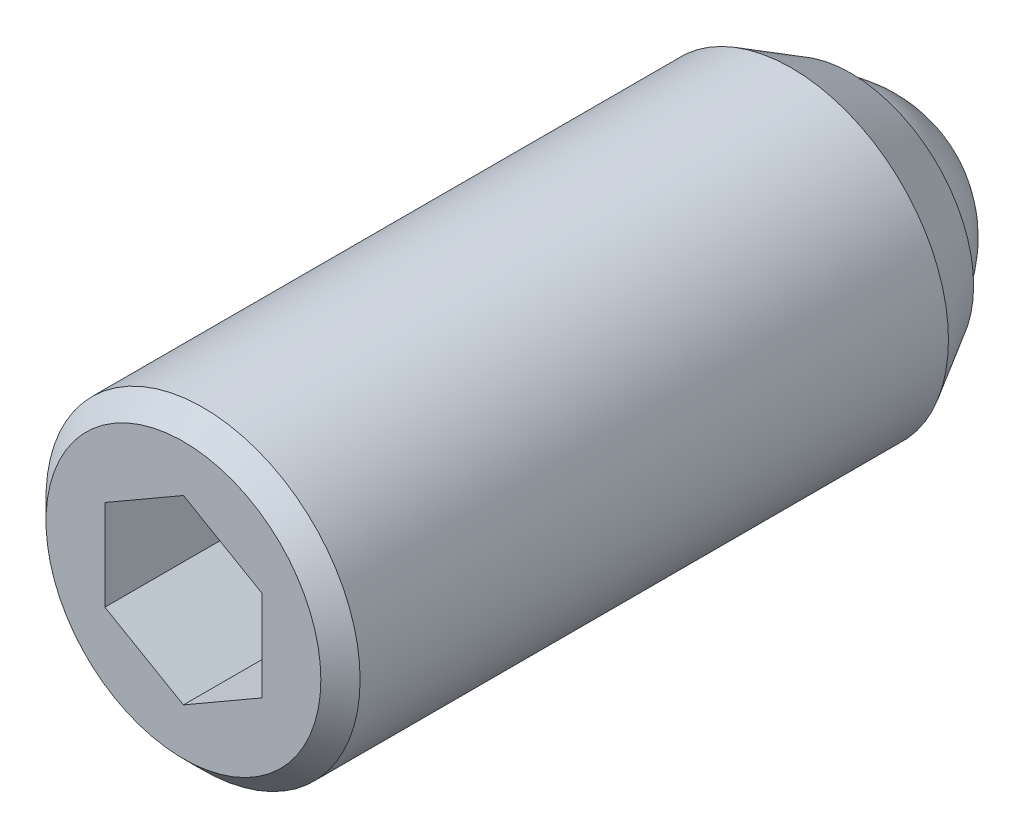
ISO-10303-21;
HEADER;
FILE_DESCRIPTION(('STEP AP214'),'2;1');
FILE_NAME('part.step','',(''),(''),'','','');
FILE_SCHEMA(('AUTOMOTIVE_DESIGN { 1 0 10303 214 1 1 1 1 }'));
ENDSEC;
DATA;
#1=APPLICATION_CONTEXT('core data for automotive mechanical design processes');
#2=APPLICATION_PROTOCOL_DEFINITION('international standard','automotive_design',2000,#1);
#3=PRODUCT_CONTEXT('',#1,'mechanical');
#4=PRODUCT('Part','Part','',(#3));
#5=PRODUCT_RELATED_PRODUCT_CATEGORY('part','',(#4));
#6=PRODUCT_DEFINITION_FORMATION('','',#4);
#7=PRODUCT_DEFINITION_CONTEXT('part definition',#1,'design');
#8=PRODUCT_DEFINITION('design','',#6,#7);
#9=PRODUCT_DEFINITION_SHAPE('','',#8);
#10=(LENGTH_UNIT() NAMED_UNIT(*) SI_UNIT(.MILLI.,.METRE.));
#11=(NAMED_UNIT(*) PLANE_ANGLE_UNIT() SI_UNIT($,.RADIAN.));
#12=(NAMED_UNIT(*) SI_UNIT($,.STERADIAN.) SOLID_ANGLE_UNIT());
#13=UNCERTAINTY_MEASURE_WITH_UNIT(LENGTH_MEASURE(1.E-05),#10,'distance_accuracy_value','');
#14=(GEOMETRIC_REPRESENTATION_CONTEXT(3) GLOBAL_UNCERTAINTY_ASSIGNED_CONTEXT((#13)) GLOBAL_UNIT_ASSIGNED_CONTEXT((#10,
#11,#12)) REPRESENTATION_CONTEXT('',''));
#15=CARTESIAN_POINT('',(0.,0.,0.));
#16=DIRECTION('',(0.,0.,1.));
#17=DIRECTION('',(1.,0.,0.));
#18=AXIS2_PLACEMENT_3D('',#15,#16,#17);
#19=CARTESIAN_POINT('',(4.,2.30940107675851,35.5));
#20=DIRECTION('',(0.5,0.86602540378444,0.));
#21=DIRECTION('',(0.86602540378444,-0.5,0.));
#22=AXIS2_PLACEMENT_3D('',#19,#20,#21);
#23=PLANE('',#22);
#24=DIRECTION('',(0.,0.,1.));
#25=VECTOR('',#24,1.);
#26=CARTESIAN_POINT('',(4.,2.30940107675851,35.5));
#27=LINE('',#26,#25);
#28=CARTESIAN_POINT('',(4.,2.30940107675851,32.));
#29=VERTEX_POINT('',#28);
#30=CARTESIAN_POINT('',(4.,2.30940107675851,38.));
#31=VERTEX_POINT('',#30);
#32=EDGE_CURVE('E68',#29,#31,#27,.T.);
#33=ORIENTED_EDGE('',*,*,#32,.T.);
#34=DIRECTION('',(-0.86602540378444,0.5,0.));
#35=VECTOR('',#34,1.);
#36=CARTESIAN_POINT('',(4.,2.30940107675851,38.));
#37=LINE('',#36,#35);
#38=CARTESIAN_POINT('',(0.,4.618802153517,38.));
#39=VERTEX_POINT('',#38);
#40=EDGE_CURVE('E29',#31,#39,#37,.T.);
#41=ORIENTED_EDGE('',*,*,#40,.T.);
#42=DIRECTION('',(0.,0.,1.));
#43=VECTOR('',#42,1.);
#44=CARTESIAN_POINT('',(0.,4.618802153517,35.5));
#45=LINE('',#44,#43);
#46=CARTESIAN_POINT('',(0.,4.618802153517,32.));
#47=VERTEX_POINT('',#46);
#48=EDGE_CURVE('E80',#47,#39,#45,.T.);
#49=ORIENTED_EDGE('',*,*,#48,.F.);
#50=DIRECTION('',(-0.86602540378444,0.5,0.));
#51=VECTOR('',#50,1.);
#52=CARTESIAN_POINT('',(4.,2.30940107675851,32.));
#53=LINE('',#52,#51);
#54=EDGE_CURVE('E79',#29,#47,#53,.T.);
#55=ORIENTED_EDGE('',*,*,#54,.F.);
#56=EDGE_LOOP('',(#33,#41,#49,#55));
#57=FACE_BOUND('',#56,.T.);
#58=ADVANCED_FACE('F14',(#57),#23,.F.);
#59=CARTESIAN_POINT('',(4.,-2.30940107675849,35.5));
#60=DIRECTION('',(1.,0.,0.));
#61=DIRECTION('',(0.,-1.,0.));
#62=AXIS2_PLACEMENT_3D('',#59,#60,#61);
#63=PLANE('',#62);
#64=DIRECTION('',(0.,0.,1.));
#65=VECTOR('',#64,1.);
#66=CARTESIAN_POINT('',(4.,-2.30940107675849,35.5));
#67=LINE('',#66,#65);
#68=CARTESIAN_POINT('',(4.,-2.30940107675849,32.));
#69=VERTEX_POINT('',#68);
#70=CARTESIAN_POINT('',(4.,-2.30940107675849,38.));
#71=VERTEX_POINT('',#70);
#72=EDGE_CURVE('E76',#69,#71,#67,.T.);
#73=ORIENTED_EDGE('',*,*,#72,.T.);
#74=DIRECTION('',(0.,1.,0.));
#75=VECTOR('',#74,1.);
#76=CARTESIAN_POINT('',(4.,-2.30940107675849,38.));
#77=LINE('',#76,#75);
#78=EDGE_CURVE('E75',#71,#31,#77,.T.);
#79=ORIENTED_EDGE('',*,*,#78,.T.);
#80=ORIENTED_EDGE('',*,*,#32,.F.);
#81=DIRECTION('',(0.,1.,0.));
#82=VECTOR('',#81,1.);
#83=CARTESIAN_POINT('',(4.,-2.30940107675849,32.));
#84=LINE('',#83,#82);
#85=EDGE_CURVE('E72',#69,#29,#84,.T.);
#86=ORIENTED_EDGE('',*,*,#85,.F.);
#87=EDGE_LOOP('',(#73,#79,#80,#86));
#88=FACE_BOUND('',#87,.T.);
#89=ADVANCED_FACE('F70',(#88),#63,.F.);
#90=CARTESIAN_POINT('',(4.,-2.30940107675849,35.5));
#91=DIRECTION('',(-0.5,0.866025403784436,0.));
#92=DIRECTION('',(0.866025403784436,0.5,0.));
#93=AXIS2_PLACEMENT_3D('',#90,#91,#92);
#94=PLANE('',#93);
#95=DIRECTION('',(0.,0.,1.));
#96=VECTOR('',#95,1.);
#97=CARTESIAN_POINT('',(0.,-4.61880215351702,35.5));
#98=LINE('',#97,#96);
#99=CARTESIAN_POINT('',(0.,-4.61880215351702,32.));
#100=VERTEX_POINT('',#99);
#101=CARTESIAN_POINT('',(0.,-4.61880215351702,38.));
#102=VERTEX_POINT('',#101);
#103=EDGE_CURVE('E122',#100,#102,#98,.T.);
#104=ORIENTED_EDGE('',*,*,#103,.T.);
#105=DIRECTION('',(-0.866025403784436,-0.5,0.));
#106=VECTOR('',#105,1.);
#107=CARTESIAN_POINT('',(4.,-2.30940107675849,38.));
#108=LINE('',#107,#106);
#109=EDGE_CURVE('E113',#71,#102,#108,.T.);
#110=ORIENTED_EDGE('',*,*,#109,.F.);
#111=ORIENTED_EDGE('',*,*,#72,.F.);
#112=DIRECTION('',(0.866025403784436,0.5,0.));
#113=VECTOR('',#112,1.);
#114=CARTESIAN_POINT('',(0.,-4.61880215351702,32.));
#115=LINE('',#114,#113);
#116=EDGE_CURVE('E89',#100,#69,#115,.T.);
#117=ORIENTED_EDGE('',*,*,#116,.F.);
#118=EDGE_LOOP('',(#104,#110,#111,#117));
#119=FACE_BOUND('',#118,.T.);
#120=ADVANCED_FACE('F147',(#119),#94,.T.);
#121=CARTESIAN_POINT('',(-4.,-2.30940107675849,35.5));
#122=DIRECTION('',(-0.5,-0.866025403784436,0.));
#123=DIRECTION('',(-0.866025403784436,0.5,0.));
#124=AXIS2_PLACEMENT_3D('',#121,#122,#123);
#125=PLANE('',#124);
#126=DIRECTION('',(0.,0.,1.));
#127=VECTOR('',#126,1.);
#128=CARTESIAN_POINT('',(-4.,-2.30940107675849,35.5));
#129=LINE('',#128,#127);
#130=CARTESIAN_POINT('',(-4.,-2.30940107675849,32.));
#131=VERTEX_POINT('',#130);
#132=CARTESIAN_POINT('',(-4.,-2.30940107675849,38.));
#133=VERTEX_POINT('',#132);
#134=EDGE_CURVE('E120',#131,#133,#129,.T.);
#135=ORIENTED_EDGE('',*,*,#134,.T.);
#136=DIRECTION('',(0.866025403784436,-0.5,0.));
#137=VECTOR('',#136,1.);
#138=CARTESIAN_POINT('',(-4.,-2.30940107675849,38.));
#139=LINE('',#138,#137);
#140=EDGE_CURVE('E111',#133,#102,#139,.T.);
#141=ORIENTED_EDGE('',*,*,#140,.T.);
#142=ORIENTED_EDGE('',*,*,#103,.F.);
#143=DIRECTION('',(0.866025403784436,-0.5,0.));
#144=VECTOR('',#143,1.);
#145=CARTESIAN_POINT('',(-4.,-2.30940107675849,32.));
#146=LINE('',#145,#144);
#147=EDGE_CURVE('E101',#131,#100,#146,.T.);
#148=ORIENTED_EDGE('',*,*,#147,.F.);
#149=EDGE_LOOP('',(#135,#141,#142,#148));
#150=FACE_BOUND('',#149,.T.);
#151=ADVANCED_FACE('F157',(#150),#125,.F.);
#152=CARTESIAN_POINT('',(-4.,-2.30940107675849,35.5));
#153=DIRECTION('',(1.,0.,0.));
#154=DIRECTION('',(0.,-1.,0.));
#155=AXIS2_PLACEMENT_3D('',#152,#153,#154);
#156=PLANE('',#155);
#157=DIRECTION('',(0.,0.,1.));
#158=VECTOR('',#157,1.);
#159=CARTESIAN_POINT('',(-4.,2.30940107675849,35.5));
#160=LINE('',#159,#158);
#161=CARTESIAN_POINT('',(-4.,2.30940107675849,32.));
#162=VERTEX_POINT('',#161);
#163=CARTESIAN_POINT('',(-4.,2.30940107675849,38.));
#164=VERTEX_POINT('',#163);
#165=EDGE_CURVE('E37',#162,#164,#160,.T.);
#166=ORIENTED_EDGE('',*,*,#165,.T.);
#167=DIRECTION('',(0.,1.,0.));
#168=VECTOR('',#167,1.);
#169=CARTESIAN_POINT('',(-4.,-2.30940107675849,38.));
#170=LINE('',#169,#168);
#171=EDGE_CURVE('E108',#133,#164,#170,.T.);
#172=ORIENTED_EDGE('',*,*,#171,.F.);
#173=ORIENTED_EDGE('',*,*,#134,.F.);
#174=DIRECTION('',(0.,-1.,0.));
#175=VECTOR('',#174,1.);
#176=CARTESIAN_POINT('',(-4.,2.30940107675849,32.));
#177=LINE('',#176,#175);
#178=EDGE_CURVE('E98',#162,#131,#177,.T.);
#179=ORIENTED_EDGE('',*,*,#178,.F.);
#180=EDGE_LOOP('',(#166,#172,#173,#179));
#181=FACE_BOUND('',#180,.T.);
#182=ADVANCED_FACE('F153',(#181),#156,.T.);
#183=CARTESIAN_POINT('',(-4.,2.30940107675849,35.5));
#184=DIRECTION('',(0.5,-0.866025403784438,0.));
#185=DIRECTION('',(-0.866025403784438,-0.5,0.));
#186=AXIS2_PLACEMENT_3D('',#183,#184,#185);
#187=PLANE('',#186);
#188=ORIENTED_EDGE('',*,*,#165,.F.);
#189=DIRECTION('',(-0.866025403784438,-0.5,0.));
#190=VECTOR('',#189,1.);
#191=CARTESIAN_POINT('',(0.,4.618802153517,32.));
#192=LINE('',#191,#190);
#193=EDGE_CURVE('E84',#47,#162,#192,.T.);
#194=ORIENTED_EDGE('',*,*,#193,.F.);
#195=ORIENTED_EDGE('',*,*,#48,.T.);
#196=DIRECTION('',(0.866025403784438,0.5,0.));
#197=VECTOR('',#196,1.);
#198=CARTESIAN_POINT('',(-4.,2.30940107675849,38.));
#199=LINE('',#198,#197);
#200=EDGE_CURVE('E105',#164,#39,#199,.T.);
#201=ORIENTED_EDGE('',*,*,#200,.F.);
#202=EDGE_LOOP('',(#188,#194,#195,#201));
#203=FACE_BOUND('',#202,.T.);
#204=ADVANCED_FACE('F150',(#203),#187,.T.);
#205=CARTESIAN_POINT('',(0.,0.,37.75));
#206=DIRECTION('',(0.,0.,-1.));
#207=DIRECTION('',(1.,0.,0.));
#208=AXIS2_PLACEMENT_3D('',#205,#206,#207);
#209=CYLINDRICAL_SURFACE('',#208,8.);
#210=CARTESIAN_POINT('',(0.,0.,37.));
#211=DIRECTION('',(0.,0.,-1.));
#212=DIRECTION('',(1.,0.,0.));
#213=AXIS2_PLACEMENT_3D('',#210,#211,#212);
#214=CIRCLE('',#213,8.);
#215=CARTESIAN_POINT('',(8.,0.,37.));
#216=VERTEX_POINT('',#215);
#217=EDGE_CURVE('E9',#216,#216,#214,.T.);
#218=ORIENTED_EDGE('',*,*,#217,.T.);
#219=EDGE_LOOP('',(#218));
#220=FACE_BOUND('',#219,.T.);
#221=CARTESIAN_POINT('',(0.,0.,7.03108891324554));
#222=DIRECTION('',(0.,0.,-1.));
#223=DIRECTION('',(-1.,0.,0.));
#224=AXIS2_PLACEMENT_3D('',#221,#222,#223);
#225=CIRCLE('',#224,8.);
#226=CARTESIAN_POINT('',(-8.,0.,7.03108891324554));
#227=VERTEX_POINT('',#226);
#228=EDGE_CURVE('E244',#227,#227,#225,.T.);
#229=ORIENTED_EDGE('',*,*,#228,.F.);
#230=EDGE_LOOP('',(#229));
#231=FACE_BOUND('',#230,.T.);
#232=ADVANCED_FACE('F16',(#220,#231),#209,.T.);
#233=CARTESIAN_POINT('',(0.,0.,37.));
#234=DIRECTION('',(0.,0.,-1.));
#235=DIRECTION('',(1.,0.,0.));
#236=AXIS2_PLACEMENT_3D('',#233,#234,#235);
#237=CONICAL_SURFACE('',#236,8.,0.785398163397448);
#238=CARTESIAN_POINT('',(0.,0.,38.));
#239=DIRECTION('',(0.,0.,-1.));
#240=DIRECTION('',(1.,0.,0.));
#241=AXIS2_PLACEMENT_3D('',#238,#239,#240);
#242=CIRCLE('',#241,7.);
#243=CARTESIAN_POINT('',(7.,0.,38.));
#244=VERTEX_POINT('',#243);
#245=EDGE_CURVE('E22',#244,#244,#242,.T.);
#246=ORIENTED_EDGE('',*,*,#245,.T.);
#247=EDGE_LOOP('',(#246));
#248=FACE_BOUND('',#247,.T.);
#249=ORIENTED_EDGE('',*,*,#217,.F.);
#250=EDGE_LOOP('',(#249));
#251=FACE_BOUND('',#250,.T.);
#252=ADVANCED_FACE('F127',(#248,#251),#237,.T.);
#253=CARTESIAN_POINT('',(0.,0.,38.));
#254=DIRECTION('',(0.,0.,-1.));
#255=DIRECTION('',(1.,0.,0.));
#256=AXIS2_PLACEMENT_3D('',#253,#254,#255);
#257=PLANE('',#256);
#258=ORIENTED_EDGE('',*,*,#200,.T.);
#259=ORIENTED_EDGE('',*,*,#40,.F.);
#260=ORIENTED_EDGE('',*,*,#78,.F.);
#261=ORIENTED_EDGE('',*,*,#109,.T.);
#262=ORIENTED_EDGE('',*,*,#140,.F.);
#263=ORIENTED_EDGE('',*,*,#171,.T.);
#264=EDGE_LOOP('',(#258,#259,#260,#261,#262,#263));
#265=FACE_BOUND('',#264,.T.);
#266=ORIENTED_EDGE('',*,*,#245,.F.);
#267=EDGE_LOOP('',(#266));
#268=FACE_BOUND('',#267,.T.);
#269=ADVANCED_FACE('F130',(#265,#268),#257,.F.);
#270=CARTESIAN_POINT('',(4.,2.30940107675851,32.));
#271=DIRECTION('',(0.,0.,1.));
#272=DIRECTION('',(1.,0.,0.));
#273=AXIS2_PLACEMENT_3D('',#270,#271,#272);
#274=PLANE('',#273);
#275=ORIENTED_EDGE('',*,*,#85,.T.);
#276=ORIENTED_EDGE('',*,*,#54,.T.);
#277=ORIENTED_EDGE('',*,*,#193,.T.);
#278=ORIENTED_EDGE('',*,*,#178,.T.);
#279=ORIENTED_EDGE('',*,*,#147,.T.);
#280=ORIENTED_EDGE('',*,*,#116,.T.);
#281=EDGE_LOOP('',(#275,#276,#277,#278,#279,#280));
#282=FACE_BOUND('',#281,.T.);
#283=ADVANCED_FACE('F86',(#282),#274,.T.);
#284=CARTESIAN_POINT('',(0.,0.,6.));
#285=DIRECTION('',(0.,0.,-1.));
#286=DIRECTION('',(-1.,0.,0.));
#287=AXIS2_PLACEMENT_3D('',#284,#285,#286);
#288=SPHERICAL_SURFACE('',#287,6.);
#289=CARTESIAN_POINT('',(0.,0.,4.));
#290=DIRECTION('',(0.,0.,-1.));
#291=DIRECTION('',(-1.,0.,0.));
#292=AXIS2_PLACEMENT_3D('',#289,#290,#291);
#293=CIRCLE('',#292,5.65685424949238);
#294=CARTESIAN_POINT('',(-5.65685424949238,0.,4.));
#295=VERTEX_POINT('',#294);
#296=EDGE_CURVE('E90',#295,#295,#293,.T.);
#297=ORIENTED_EDGE('',*,*,#296,.T.);
#298=EDGE_LOOP('',(#297));
#299=FACE_BOUND('',#298,.T.);
#300=ADVANCED_FACE('F139',(#299),#288,.T.);
#301=CARTESIAN_POINT('',(-5.65685424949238,0.,4.));
#302=DIRECTION('',(0.,0.,-1.));
#303=DIRECTION('',(-1.,0.,0.));
#304=AXIS2_PLACEMENT_3D('',#301,#302,#303);
#305=PLANE('',#304);
#306=CARTESIAN_POINT('',(0.,0.,4.));
#307=DIRECTION('',(0.,0.,-1.));
#308=DIRECTION('',(-1.,0.,0.));
#309=AXIS2_PLACEMENT_3D('',#306,#307,#308);
#310=CIRCLE('',#309,6.25);
#311=CARTESIAN_POINT('',(-6.25,0.,4.));
#312=VERTEX_POINT('',#311);
#313=EDGE_CURVE('E93',#312,#312,#310,.T.);
#314=ORIENTED_EDGE('',*,*,#313,.T.);
#315=EDGE_LOOP('',(#314));
#316=FACE_BOUND('',#315,.T.);
#317=ORIENTED_EDGE('',*,*,#296,.F.);
#318=EDGE_LOOP('',(#317));
#319=FACE_BOUND('',#318,.T.);
#320=ADVANCED_FACE('F216',(#316,#319),#305,.T.);
#321=CARTESIAN_POINT('',(0.,0.,4.));
#322=DIRECTION('',(0.,0.,1.));
#323=DIRECTION('',(1.,0.,0.));
#324=AXIS2_PLACEMENT_3D('',#321,#322,#323);
#325=CONICAL_SURFACE('',#324,6.25,0.523598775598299);
#326=ORIENTED_EDGE('',*,*,#228,.T.);
#327=EDGE_LOOP('',(#326));
#328=FACE_BOUND('',#327,.T.);
#329=ORIENTED_EDGE('',*,*,#313,.F.);
#330=EDGE_LOOP('',(#329));
#331=FACE_BOUND('',#330,.T.);
#332=ADVANCED_FACE('F225',(#328,#331),#325,.T.);
#333=CLOSED_SHELL('',(#58,#89,#120,#151,#182,#204,#232,#252,#269,#283,#300,#320,#332));
#334=MANIFOLD_SOLID_BREP('B1',#333);
#335=ADVANCED_BREP_SHAPE_REPRESENTATION('',(#18,#334),#14);
#336=SHAPE_DEFINITION_REPRESENTATION(#9,#335);
ENDSEC;
END-ISO-10303-21;
